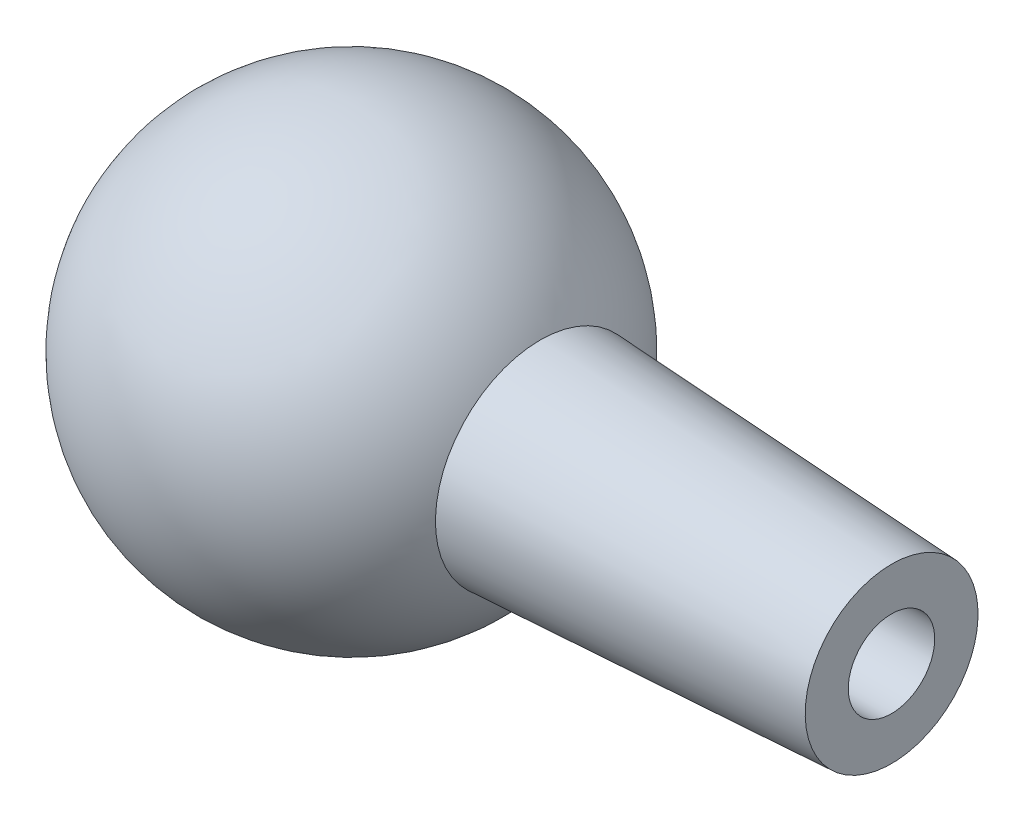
ISO-10303-21;
HEADER;
FILE_DESCRIPTION(('STEP AP214'),'2;1');
FILE_NAME('part.step','',(''),(''),'','','');
FILE_SCHEMA(('AUTOMOTIVE_DESIGN { 1 0 10303 214 1 1 1 1 }'));
ENDSEC;
DATA;
#1=APPLICATION_CONTEXT('core data for automotive mechanical design processes');
#2=APPLICATION_PROTOCOL_DEFINITION('international standard','automotive_design',2000,#1);
#3=PRODUCT_CONTEXT('',#1,'mechanical');
#4=PRODUCT('Part','Part','',(#3));
#5=PRODUCT_RELATED_PRODUCT_CATEGORY('part','',(#4));
#6=PRODUCT_DEFINITION_FORMATION('','',#4);
#7=PRODUCT_DEFINITION_CONTEXT('part definition',#1,'design');
#8=PRODUCT_DEFINITION('design','',#6,#7);
#9=PRODUCT_DEFINITION_SHAPE('','',#8);
#10=(LENGTH_UNIT() NAMED_UNIT(*) SI_UNIT(.MILLI.,.METRE.));
#11=(NAMED_UNIT(*) PLANE_ANGLE_UNIT() SI_UNIT($,.RADIAN.));
#12=(NAMED_UNIT(*) SI_UNIT($,.STERADIAN.) SOLID_ANGLE_UNIT());
#13=UNCERTAINTY_MEASURE_WITH_UNIT(LENGTH_MEASURE(1.E-05),#10,'distance_accuracy_value','');
#14=(GEOMETRIC_REPRESENTATION_CONTEXT(3) GLOBAL_UNCERTAINTY_ASSIGNED_CONTEXT((#13)) GLOBAL_UNIT_ASSIGNED_CONTEXT((#10,
#11,#12)) REPRESENTATION_CONTEXT('',''));
#15=CARTESIAN_POINT('',(0.,0.,0.));
#16=DIRECTION('',(0.,0.,1.));
#17=DIRECTION('',(1.,0.,0.));
#18=AXIS2_PLACEMENT_3D('',#15,#16,#17);
#19=CARTESIAN_POINT('',(0.,0.,0.));
#20=DIRECTION('',(1.,0.,0.));
#21=DIRECTION('',(0.,1.,0.));
#22=AXIS2_PLACEMENT_3D('',#19,#20,#21);
#23=CONICAL_SURFACE('',#22,1.27,1.5676280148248);
#24=CARTESIAN_POINT('',(0.00402374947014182,0.,0.));
#25=DIRECTION('',(1.,0.,0.));
#26=DIRECTION('',(0.,1.,0.));
#27=AXIS2_PLACEMENT_3D('',#24,#25,#26);
#28=CIRCLE('',#27,2.53999362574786);
#29=CARTESIAN_POINT('',(0.00402374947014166,2.53999362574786,0.));
#30=VERTEX_POINT('',#29);
#31=EDGE_CURVE('E49',#30,#30,#28,.T.);
#32=ORIENTED_EDGE('',*,*,#31,.T.);
#33=EDGE_LOOP('',(#32));
#34=FACE_BOUND('',#33,.T.);
#35=CARTESIAN_POINT('',(0.,0.,0.));
#36=DIRECTION('',(1.,0.,0.));
#37=DIRECTION('',(0.,1.,0.));
#38=AXIS2_PLACEMENT_3D('',#35,#36,#37);
#39=CIRCLE('',#38,1.27);
#40=CARTESIAN_POINT('',(0.,1.27,0.));
#41=VERTEX_POINT('',#40);
#42=EDGE_CURVE('E10',#41,#41,#39,.T.);
#43=ORIENTED_EDGE('',*,*,#42,.F.);
#44=EDGE_LOOP('',(#43));
#45=FACE_BOUND('',#44,.T.);
#46=ADVANCED_FACE('F30',(#34,#45),#23,.F.);
#47=CARTESIAN_POINT('',(0.,0.,0.));
#48=DIRECTION('',(1.,0.,0.));
#49=DIRECTION('',(0.,1.,0.));
#50=AXIS2_PLACEMENT_3D('',#47,#48,#49);
#51=CYLINDRICAL_SURFACE('',#50,1.27);
#52=ORIENTED_EDGE('',*,*,#42,.T.);
#53=EDGE_LOOP('',(#52));
#54=FACE_BOUND('',#53,.T.);
#55=CARTESIAN_POINT('',(-20.2744090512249,0.,0.));
#56=DIRECTION('',(1.,0.,0.));
#57=DIRECTION('',(0.,1.,0.));
#58=AXIS2_PLACEMENT_3D('',#55,#56,#57);
#59=CIRCLE('',#58,1.27);
#60=CARTESIAN_POINT('',(-20.2744090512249,1.27,0.));
#61=VERTEX_POINT('',#60);
#62=EDGE_CURVE('E36',#61,#61,#59,.T.);
#63=ORIENTED_EDGE('',*,*,#62,.F.);
#64=EDGE_LOOP('',(#63));
#65=FACE_BOUND('',#64,.T.);
#66=ADVANCED_FACE('F67',(#54,#65),#51,.F.);
#67=CARTESIAN_POINT('',(-20.2744090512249,0.,0.));
#68=DIRECTION('',(1.,0.,0.));
#69=DIRECTION('',(0.,1.,0.));
#70=AXIS2_PLACEMENT_3D('',#67,#68,#69);
#71=TOROIDAL_SURFACE('',#70,2.54,1.27);
#72=ORIENTED_EDGE('',*,*,#62,.T.);
#73=EDGE_LOOP('',(#72));
#74=FACE_BOUND('',#73,.T.);
#75=CARTESIAN_POINT('',(-21.3742613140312,0.,0.));
#76=DIRECTION('',(1.,0.,0.));
#77=DIRECTION('',(0.,1.,0.));
#78=AXIS2_PLACEMENT_3D('',#75,#76,#77);
#79=CIRCLE('',#78,3.175);
#80=CARTESIAN_POINT('',(-21.3742613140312,3.17499999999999,0.));
#81=VERTEX_POINT('',#80);
#82=EDGE_CURVE('E40',#81,#81,#79,.T.);
#83=ORIENTED_EDGE('',*,*,#82,.F.);
#84=EDGE_LOOP('',(#83));
#85=FACE_BOUND('',#84,.T.);
#86=ADVANCED_FACE('F63',(#74,#85),#71,.T.);
#87=CARTESIAN_POINT('',(-15.875,0.,0.));
#88=DIRECTION('',(1.,0.,0.));
#89=DIRECTION('',(0.,1.,0.));
#90=AXIS2_PLACEMENT_3D('',#87,#88,#89);
#91=SPHERICAL_SURFACE('',#90,6.35);
#92=CARTESIAN_POINT('',(-10.3226344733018,0.,0.));
#93=DIRECTION('',(1.,0.,0.));
#94=DIRECTION('',(0.,1.,0.));
#95=AXIS2_PLACEMENT_3D('',#92,#93,#94);
#96=CIRCLE('',#95,3.0811908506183);
#97=CARTESIAN_POINT('',(-10.3226344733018,3.0811908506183,0.));
#98=VERTEX_POINT('',#97);
#99=EDGE_CURVE('E44',#98,#98,#96,.T.);
#100=CARTESIAN_POINT('',(-21.3742613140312,3.17499999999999,0.));
#101=CARTESIAN_POINT('',(-21.3044381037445,3.29595172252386,0.));
#102=CARTESIAN_POINT('',(-21.2306129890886,3.41459199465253,0.));
#103=CARTESIAN_POINT('',(-21.0753065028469,3.64675091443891,0.));
#104=CARTESIAN_POINT('',(-20.993825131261,3.76026956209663,0.));
#105=CARTESIAN_POINT('',(-20.8235536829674,3.98168650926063,0.));
#106=CARTESIAN_POINT('',(-20.7347636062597,4.08958480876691,0.));
#107=CARTESIAN_POINT('',(-20.5502630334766,4.29929276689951,0.));
#108=CARTESIAN_POINT('',(-20.4545525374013,4.40110242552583,0.));
#109=CARTESIAN_POINT('',(-20.2566271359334,4.59818970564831,0.));
#110=CARTESIAN_POINT('',(-20.1544122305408,4.69346732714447,0.));
#111=CARTESIAN_POINT('',(-19.943922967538,4.87707599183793,0.));
#112=CARTESIAN_POINT('',(-19.8356486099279,4.96540703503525,0.));
#113=CARTESIAN_POINT('',(-19.6135115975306,5.13473811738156,0.));
#114=CARTESIAN_POINT('',(-19.4996489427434,5.21573815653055,0.));
#115=CARTESIAN_POINT('',(-19.2668308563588,5.3700547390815,0.));
#116=CARTESIAN_POINT('',(-19.1478754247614,5.44337128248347,0.));
#117=CARTESIAN_POINT('',(-18.9053894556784,5.58200181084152,0.));
#118=CARTESIAN_POINT('',(-18.7818589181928,5.64731579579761,0.));
#119=CARTESIAN_POINT('',(-18.5307603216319,5.76965697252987,0.));
#120=CARTESIAN_POINT('',(-18.4031922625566,5.82668416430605,0.));
#121=CARTESIAN_POINT('',(-18.1445737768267,5.93220358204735,0.));
#122=CARTESIAN_POINT('',(-18.0135233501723,5.98069580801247,0.));
#123=CARTESIAN_POINT('',(-17.7485104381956,6.06893426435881,0.));
#124=CARTESIAN_POINT('',(-17.6145479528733,6.10868049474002,0.));
#125=CARTESIAN_POINT('',(-17.3442939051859,6.17925399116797,0.));
#126=CARTESIAN_POINT('',(-17.2080023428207,6.21008125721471,0.));
#127=CARTESIAN_POINT('',(-16.9336832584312,6.2626826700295,0.));
#128=CARTESIAN_POINT('',(-16.7956557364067,6.28445681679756,0.));
#129=CARTESIAN_POINT('',(-16.5184654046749,6.31885723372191,0.));
#130=CARTESIAN_POINT('',(-16.3793025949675,6.3314835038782,0.));
#131=CARTESIAN_POINT('',(-16.1004473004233,6.34753322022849,0.));
#132=CARTESIAN_POINT('',(-15.9607548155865,6.35095666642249,0.));
#133=CARTESIAN_POINT('',(-15.6814480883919,6.34858583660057,0.));
#134=CARTESIAN_POINT('',(-15.541833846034,6.34279156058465,0.));
#135=CARTESIAN_POINT('',(-15.2632911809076,6.32201050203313,0.));
#136=CARTESIAN_POINT('',(-15.124362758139,6.30702371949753,0.));
#137=CARTESIAN_POINT('',(-14.8477963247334,6.26792286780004,0.));
#138=CARTESIAN_POINT('',(-14.7101583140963,6.24380879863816,0.));
#139=CARTESIAN_POINT('',(-14.4367716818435,6.18655831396,0.));
#140=CARTESIAN_POINT('',(-14.3010230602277,6.15342189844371,0.));
#141=CARTESIAN_POINT('',(-14.0320059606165,6.07827092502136,0.));
#142=CARTESIAN_POINT('',(-13.8987374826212,6.03625636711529,0.));
#143=CARTESIAN_POINT('',(-13.6352606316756,5.94353194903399,0.));
#144=CARTESIAN_POINT('',(-13.5050522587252,5.89282208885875,0.));
#145=CARTESIAN_POINT('',(-13.2482622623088,5.78292774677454,0.));
#146=CARTESIAN_POINT('',(-13.1216806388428,5.72374326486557,0.));
#147=CARTESIAN_POINT('',(-12.8726950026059,5.59715724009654,0.));
#148=CARTESIAN_POINT('',(-12.7502909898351,5.52975569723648,0.));
#149=CARTESIAN_POINT('',(-12.5101932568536,5.38702887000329,0.));
#150=CARTESIAN_POINT('',(-12.3924995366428,5.31170358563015,0.));
#151=CARTESIAN_POINT('',(-12.1623345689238,5.15345707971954,0.));
#152=CARTESIAN_POINT('',(-12.0498633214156,5.07053585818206,0.));
#153=CARTESIAN_POINT('',(-11.830632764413,4.89745833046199,0.));
#154=CARTESIAN_POINT('',(-11.7238734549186,4.80730202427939,0.));
#155=CARTESIAN_POINT('',(-11.5165313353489,4.62014669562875,0.));
#156=CARTESIAN_POINT('',(-11.4159485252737,4.52314767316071,0.));
#157=CARTESIAN_POINT('',(-11.2213972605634,4.32272894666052,0.));
#158=CARTESIAN_POINT('',(-11.1274288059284,4.21930924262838,0.));
#159=CARTESIAN_POINT('',(-10.9465146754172,4.00649954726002,0.));
#160=CARTESIAN_POINT('',(-10.859568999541,3.8971095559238,0.));
#161=CARTESIAN_POINT('',(-10.6930807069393,3.67283410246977,0.));
#162=CARTESIAN_POINT('',(-10.6135380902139,3.55794864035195,0.));
#163=CARTESIAN_POINT('',(-10.4621949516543,3.32318679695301,0.));
#164=CARTESIAN_POINT('',(-10.3903944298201,3.2033104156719,0.));
#165=CARTESIAN_POINT('',(-10.3226344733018,3.0811908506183,0.));
#166=B_SPLINE_CURVE_WITH_KNOTS('',3,(#100,#101,#102,#103,#104,#105,#106,#107,#108,#109,#110,
#111,#112,#113,#114,#115,#116,#117,#118,#119,#120,#121,#122,#123,#124,#125,#126,#127,#128,#129,
#130,#131,#132,#133,#134,#135,#136,#137,#138,#139,#140,#141,#142,#143,#144,#145,#146,#147,#148,
#149,#150,#151,#152,#153,#154,#155,#156,#157,#158,#159,#160,#161,#162,#163,#164,#165),
.UNSPECIFIED.,.F.,.F.,(4,2,2,2,2,2,2,2,2,2,2,2,2,2,2,2,2,2,2,2,2,2,2,2,2,2,2,2,2,2,2,2,4),(0.,
0.41889923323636,0.837798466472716,1.25669769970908,1.67559693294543,2.09449616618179,
2.51339539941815,2.93229463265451,3.35119386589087,3.77009309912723,4.18899233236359,
4.60789156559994,5.0267907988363,5.44569003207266,5.86458926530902,6.28348849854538,
6.70238773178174,7.1212869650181,7.54018619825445,7.95908543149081,8.37798466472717,
8.79688389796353,9.21578313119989,9.63468236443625,10.0535815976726,10.472480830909,
10.8913800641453,11.3102792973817,11.729178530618,12.1480777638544,12.5669769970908,
12.9858762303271,13.4047754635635),.UNSPECIFIED.);
#167=EDGE_CURVE('BSEAM57',#81,#98,#166,.T.);
#168=ORIENTED_EDGE('',*,*,#82,.T.);
#169=ORIENTED_EDGE('',*,*,#99,.F.);
#170=ORIENTED_EDGE('',*,*,#167,.T.);
#171=ORIENTED_EDGE('',*,*,#167,.F.);
#172=EDGE_LOOP('',(#168,#170,#169,#171));
#173=FACE_BOUND('',#172,.T.);
#174=ADVANCED_FACE('F57',(#173),#91,.T.);
#175=CARTESIAN_POINT('',(0.00402374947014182,0.,0.));
#176=DIRECTION('',(-1.,0.,0.));
#177=DIRECTION('',(0.,-1.,0.));
#178=AXIS2_PLACEMENT_3D('',#175,#176,#177);
#179=CONICAL_SURFACE('',#178,2.53999362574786,0.0523598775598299);
#180=ORIENTED_EDGE('',*,*,#99,.T.);
#181=EDGE_LOOP('',(#180));
#182=FACE_BOUND('',#181,.T.);
#183=ORIENTED_EDGE('',*,*,#31,.F.);
#184=EDGE_LOOP('',(#183));
#185=FACE_BOUND('',#184,.T.);
#186=ADVANCED_FACE('F55',(#182,#185),#179,.T.);
#187=CLOSED_SHELL('',(#46,#66,#86,#174,#186));
#188=MANIFOLD_SOLID_BREP('B2',#187);
#189=ADVANCED_BREP_SHAPE_REPRESENTATION('',(#18,#188),#14);
#190=SHAPE_DEFINITION_REPRESENTATION(#9,#189);
ENDSEC;
END-ISO-10303-21;
